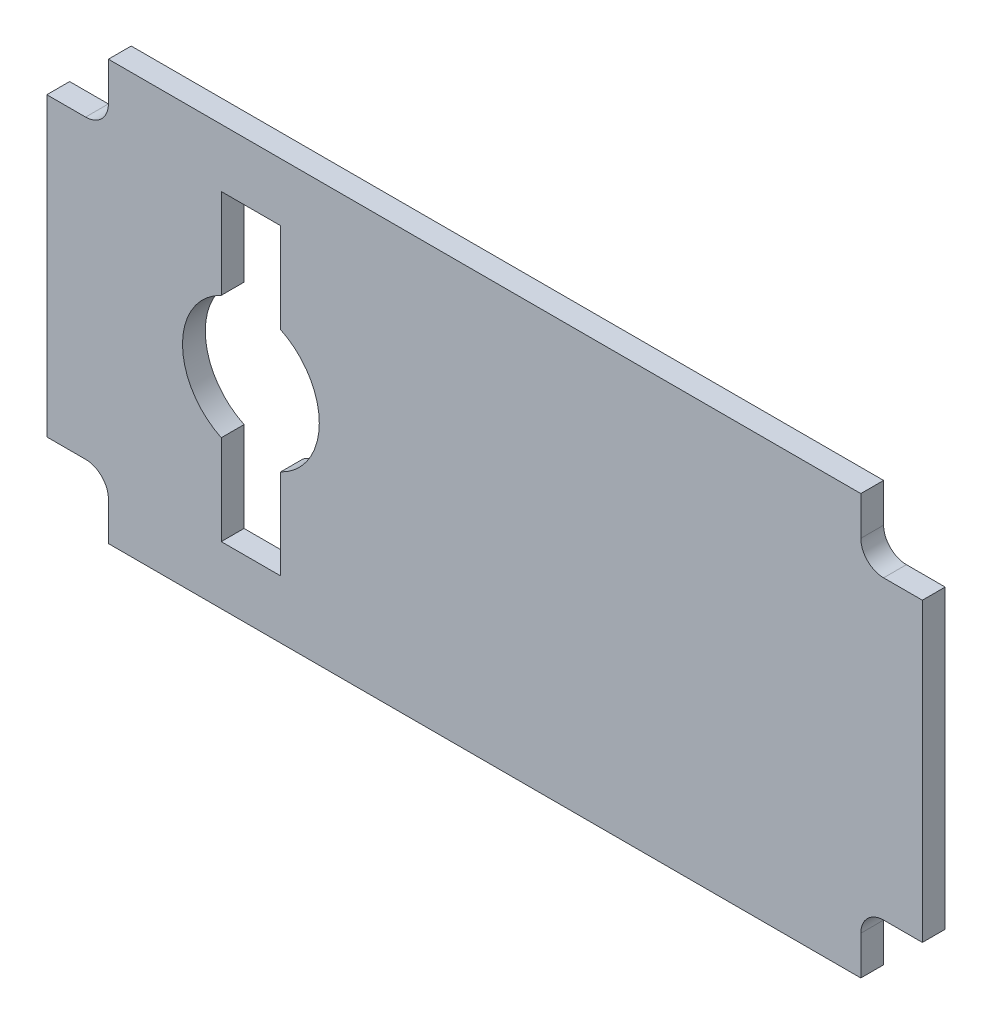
ISO-10303-21;
HEADER;
FILE_DESCRIPTION(('STEP AP214'),'2;1');
FILE_NAME('part.step','',(''),(''),'','','');
FILE_SCHEMA(('AUTOMOTIVE_DESIGN { 1 0 10303 214 1 1 1 1 }'));
ENDSEC;
DATA;
#1=APPLICATION_CONTEXT('core data for automotive mechanical design processes');
#2=APPLICATION_PROTOCOL_DEFINITION('international standard','automotive_design',2000,#1);
#3=PRODUCT_CONTEXT('',#1,'mechanical');
#4=PRODUCT('Part','Part','',(#3));
#5=PRODUCT_RELATED_PRODUCT_CATEGORY('part','',(#4));
#6=PRODUCT_DEFINITION_FORMATION('','',#4);
#7=PRODUCT_DEFINITION_CONTEXT('part definition',#1,'design');
#8=PRODUCT_DEFINITION('design','',#6,#7);
#9=PRODUCT_DEFINITION_SHAPE('','',#8);
#10=(LENGTH_UNIT() NAMED_UNIT(*) SI_UNIT(.MILLI.,.METRE.));
#11=(NAMED_UNIT(*) PLANE_ANGLE_UNIT() SI_UNIT($,.RADIAN.));
#12=(NAMED_UNIT(*) SI_UNIT($,.STERADIAN.) SOLID_ANGLE_UNIT());
#13=UNCERTAINTY_MEASURE_WITH_UNIT(LENGTH_MEASURE(1.E-05),#10,'distance_accuracy_value','');
#14=(GEOMETRIC_REPRESENTATION_CONTEXT(3) GLOBAL_UNCERTAINTY_ASSIGNED_CONTEXT((#13)) GLOBAL_UNIT_ASSIGNED_CONTEXT((#10,
#11,#12)) REPRESENTATION_CONTEXT('',''));
#15=CARTESIAN_POINT('',(0.,0.,0.));
#16=DIRECTION('',(0.,0.,1.));
#17=DIRECTION('',(1.,0.,0.));
#18=AXIS2_PLACEMENT_3D('',#15,#16,#17);
#19=CARTESIAN_POINT('',(-17.5,-7.50000000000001,1.));
#20=DIRECTION('',(0.,0.,-1.));
#21=DIRECTION('',(-1.,0.,0.));
#22=AXIS2_PLACEMENT_3D('',#19,#20,#21);
#23=PLANE('',#22);
#24=DIRECTION('',(0.,-1.,0.));
#25=VECTOR('',#24,1.);
#26=CARTESIAN_POINT('',(-16.5,-9.19999999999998,1.));
#27=LINE('',#26,#25);
#28=CARTESIAN_POINT('',(-16.5,-7.50000000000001,1.));
#29=VERTEX_POINT('',#28);
#30=CARTESIAN_POINT('',(-16.5,-9.19999999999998,1.));
#31=VERTEX_POINT('',#30);
#32=EDGE_CURVE('E286',#29,#31,#27,.T.);
#33=ORIENTED_EDGE('',*,*,#32,.T.);
#34=DIRECTION('',(1.,0.,0.));
#35=VECTOR('',#34,1.);
#36=CARTESIAN_POINT('',(-16.5,-9.19999999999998,1.));
#37=LINE('',#36,#35);
#38=CARTESIAN_POINT('',(16.5,-9.19999999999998,1.));
#39=VERTEX_POINT('',#38);
#40=EDGE_CURVE('E289',#31,#39,#37,.T.);
#41=ORIENTED_EDGE('',*,*,#40,.T.);
#42=DIRECTION('',(0.,1.,0.));
#43=VECTOR('',#42,1.);
#44=CARTESIAN_POINT('',(16.5,-7.5,1.));
#45=LINE('',#44,#43);
#46=CARTESIAN_POINT('',(16.5,-7.5,1.));
#47=VERTEX_POINT('',#46);
#48=EDGE_CURVE('E291',#39,#47,#45,.T.);
#49=ORIENTED_EDGE('',*,*,#48,.T.);
#50=CARTESIAN_POINT('',(17.5,-7.5,1.));
#51=DIRECTION('',(0.,0.,-1.));
#52=DIRECTION('',(-1.,0.,0.));
#53=AXIS2_PLACEMENT_3D('',#50,#51,#52);
#54=CIRCLE('',#53,0.999999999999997);
#55=CARTESIAN_POINT('',(17.5,-6.5,1.));
#56=VERTEX_POINT('',#55);
#57=EDGE_CURVE('E293',#47,#56,#54,.T.);
#58=ORIENTED_EDGE('',*,*,#57,.T.);
#59=DIRECTION('',(1.,0.,0.));
#60=VECTOR('',#59,1.);
#61=CARTESIAN_POINT('',(19.2,-6.5,1.));
#62=LINE('',#61,#60);
#63=CARTESIAN_POINT('',(19.2,-6.5,1.));
#64=VERTEX_POINT('',#63);
#65=EDGE_CURVE('E295',#56,#64,#62,.T.);
#66=ORIENTED_EDGE('',*,*,#65,.T.);
#67=DIRECTION('',(0.,1.,0.));
#68=VECTOR('',#67,1.);
#69=CARTESIAN_POINT('',(19.2,-6.5,1.));
#70=LINE('',#69,#68);
#71=CARTESIAN_POINT('',(19.2,6.5,1.));
#72=VERTEX_POINT('',#71);
#73=EDGE_CURVE('E297',#64,#72,#70,.T.);
#74=ORIENTED_EDGE('',*,*,#73,.T.);
#75=DIRECTION('',(-1.,0.,0.));
#76=VECTOR('',#75,1.);
#77=CARTESIAN_POINT('',(17.5,6.50000000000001,1.));
#78=LINE('',#77,#76);
#79=CARTESIAN_POINT('',(17.5,6.50000000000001,1.));
#80=VERTEX_POINT('',#79);
#81=EDGE_CURVE('E299',#72,#80,#78,.T.);
#82=ORIENTED_EDGE('',*,*,#81,.T.);
#83=CARTESIAN_POINT('',(17.5,7.49999999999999,1.));
#84=DIRECTION('',(0.,0.,-1.));
#85=DIRECTION('',(-1.,0.,0.));
#86=AXIS2_PLACEMENT_3D('',#83,#84,#85);
#87=CIRCLE('',#86,0.999999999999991);
#88=CARTESIAN_POINT('',(16.5,7.5,1.));
#89=VERTEX_POINT('',#88);
#90=EDGE_CURVE('E301',#80,#89,#87,.T.);
#91=ORIENTED_EDGE('',*,*,#90,.T.);
#92=DIRECTION('',(0.,1.,0.));
#93=VECTOR('',#92,1.);
#94=CARTESIAN_POINT('',(16.5,9.2,1.));
#95=LINE('',#94,#93);
#96=CARTESIAN_POINT('',(16.5,9.2,1.));
#97=VERTEX_POINT('',#96);
#98=EDGE_CURVE('E303',#89,#97,#95,.T.);
#99=ORIENTED_EDGE('',*,*,#98,.T.);
#100=DIRECTION('',(-1.,0.,0.));
#101=VECTOR('',#100,1.);
#102=CARTESIAN_POINT('',(16.5,9.2,1.));
#103=LINE('',#102,#101);
#104=CARTESIAN_POINT('',(-16.5,9.2,1.));
#105=VERTEX_POINT('',#104);
#106=EDGE_CURVE('E305',#97,#105,#103,.T.);
#107=ORIENTED_EDGE('',*,*,#106,.T.);
#108=DIRECTION('',(0.,-1.,0.));
#109=VECTOR('',#108,1.);
#110=CARTESIAN_POINT('',(-16.5,7.5,1.));
#111=LINE('',#110,#109);
#112=CARTESIAN_POINT('',(-16.5,7.5,1.));
#113=VERTEX_POINT('',#112);
#114=EDGE_CURVE('E307',#105,#113,#111,.T.);
#115=ORIENTED_EDGE('',*,*,#114,.T.);
#116=CARTESIAN_POINT('',(-17.5,7.5,1.));
#117=DIRECTION('',(0.,0.,-1.));
#118=DIRECTION('',(-1.,0.,0.));
#119=AXIS2_PLACEMENT_3D('',#116,#117,#118);
#120=CIRCLE('',#119,0.999999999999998);
#121=CARTESIAN_POINT('',(-17.5,6.5,1.));
#122=VERTEX_POINT('',#121);
#123=EDGE_CURVE('E309',#113,#122,#120,.T.);
#124=ORIENTED_EDGE('',*,*,#123,.T.);
#125=DIRECTION('',(-1.,0.,0.));
#126=VECTOR('',#125,1.);
#127=CARTESIAN_POINT('',(-19.2,6.49999999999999,1.));
#128=LINE('',#127,#126);
#129=CARTESIAN_POINT('',(-19.2,6.49999999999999,1.));
#130=VERTEX_POINT('',#129);
#131=EDGE_CURVE('E311',#122,#130,#128,.T.);
#132=ORIENTED_EDGE('',*,*,#131,.T.);
#133=DIRECTION('',(0.,-1.,0.));
#134=VECTOR('',#133,1.);
#135=CARTESIAN_POINT('',(-19.2,6.49999999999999,1.));
#136=LINE('',#135,#134);
#137=CARTESIAN_POINT('',(-19.2,-6.50000000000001,1.));
#138=VERTEX_POINT('',#137);
#139=EDGE_CURVE('E313',#130,#138,#136,.T.);
#140=ORIENTED_EDGE('',*,*,#139,.T.);
#141=DIRECTION('',(1.,0.,0.));
#142=VECTOR('',#141,1.);
#143=CARTESIAN_POINT('',(-17.5,-6.50000000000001,1.));
#144=LINE('',#143,#142);
#145=CARTESIAN_POINT('',(-17.5,-6.50000000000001,1.));
#146=VERTEX_POINT('',#145);
#147=EDGE_CURVE('E315',#138,#146,#144,.T.);
#148=ORIENTED_EDGE('',*,*,#147,.T.);
#149=CARTESIAN_POINT('',(-17.5,-7.50000000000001,1.));
#150=DIRECTION('',(0.,0.,-1.));
#151=DIRECTION('',(-1.,0.,0.));
#152=AXIS2_PLACEMENT_3D('',#149,#150,#151);
#153=CIRCLE('',#152,0.999999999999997);
#154=EDGE_CURVE('E317',#146,#29,#153,.T.);
#155=ORIENTED_EDGE('',*,*,#154,.T.);
#156=EDGE_LOOP('',(#33,#41,#49,#58,#66,#74,#82,#91,#99,#107,#115,#124,#132,#140,#148,#155));
#157=FACE_BOUND('',#156,.T.);
#158=CARTESIAN_POINT('',(-10.25,0.,1.));
#159=DIRECTION('',(0.,0.,1.));
#160=DIRECTION('',(1.,0.,0.));
#161=AXIS2_PLACEMENT_3D('',#158,#159,#160);
#162=CIRCLE('',#161,3.);
#163=CARTESIAN_POINT('',(-11.55,2.70370116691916,1.));
#164=VERTEX_POINT('',#163);
#165=CARTESIAN_POINT('',(-11.55,-2.70370116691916,1.));
#166=VERTEX_POINT('',#165);
#167=EDGE_CURVE('E205',#164,#166,#162,.T.);
#168=ORIENTED_EDGE('',*,*,#167,.F.);
#169=DIRECTION('',(0.,-1.,0.));
#170=VECTOR('',#169,1.);
#171=CARTESIAN_POINT('',(-11.55,2.70370116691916,1.));
#172=LINE('',#171,#170);
#173=CARTESIAN_POINT('',(-11.55,6.65,1.));
#174=VERTEX_POINT('',#173);
#175=EDGE_CURVE('E240',#174,#164,#172,.T.);
#176=ORIENTED_EDGE('',*,*,#175,.F.);
#177=DIRECTION('',(-1.,0.,0.));
#178=VECTOR('',#177,1.);
#179=CARTESIAN_POINT('',(-11.55,6.65,1.));
#180=LINE('',#179,#178);
#181=CARTESIAN_POINT('',(-8.94999999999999,6.65,1.));
#182=VERTEX_POINT('',#181);
#183=EDGE_CURVE('E238',#182,#174,#180,.T.);
#184=ORIENTED_EDGE('',*,*,#183,.F.);
#185=DIRECTION('',(0.,1.,0.));
#186=VECTOR('',#185,1.);
#187=CARTESIAN_POINT('',(-8.95,2.70370116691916,1.));
#188=LINE('',#187,#186);
#189=CARTESIAN_POINT('',(-8.95,2.70370116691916,1.));
#190=VERTEX_POINT('',#189);
#191=EDGE_CURVE('E236',#190,#182,#188,.T.);
#192=ORIENTED_EDGE('',*,*,#191,.F.);
#193=CARTESIAN_POINT('',(-10.25,0.,1.));
#194=DIRECTION('',(0.,0.,1.));
#195=DIRECTION('',(1.,0.,0.));
#196=AXIS2_PLACEMENT_3D('',#193,#194,#195);
#197=CIRCLE('',#196,3.);
#198=CARTESIAN_POINT('',(-8.95,-2.70370116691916,1.));
#199=VERTEX_POINT('',#198);
#200=EDGE_CURVE('E234',#199,#190,#197,.T.);
#201=ORIENTED_EDGE('',*,*,#200,.F.);
#202=DIRECTION('',(0.,1.,0.));
#203=VECTOR('',#202,1.);
#204=CARTESIAN_POINT('',(-8.94999999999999,-6.65,1.));
#205=LINE('',#204,#203);
#206=CARTESIAN_POINT('',(-8.94999999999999,-6.65,1.));
#207=VERTEX_POINT('',#206);
#208=EDGE_CURVE('E232',#207,#199,#205,.T.);
#209=ORIENTED_EDGE('',*,*,#208,.F.);
#210=DIRECTION('',(1.,0.,0.));
#211=VECTOR('',#210,1.);
#212=CARTESIAN_POINT('',(-11.55,-6.65,1.));
#213=LINE('',#212,#211);
#214=CARTESIAN_POINT('',(-11.55,-6.65,1.));
#215=VERTEX_POINT('',#214);
#216=EDGE_CURVE('E230',#215,#207,#213,.T.);
#217=ORIENTED_EDGE('',*,*,#216,.F.);
#218=DIRECTION('',(0.,-1.,0.));
#219=VECTOR('',#218,1.);
#220=CARTESIAN_POINT('',(-11.55,-6.65,1.));
#221=LINE('',#220,#219);
#222=EDGE_CURVE('E228',#166,#215,#221,.T.);
#223=ORIENTED_EDGE('',*,*,#222,.F.);
#224=EDGE_LOOP('',(#168,#176,#184,#192,#201,#209,#217,#223));
#225=FACE_BOUND('',#224,.T.);
#226=ADVANCED_FACE('F29',(#157,#225),#23,.F.);
#227=CARTESIAN_POINT('',(-17.5,-7.50000000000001,0.));
#228=DIRECTION('',(0.,0.,-1.));
#229=DIRECTION('',(-1.,0.,0.));
#230=AXIS2_PLACEMENT_3D('',#227,#228,#229);
#231=PLANE('',#230);
#232=DIRECTION('',(0.,-1.,0.));
#233=VECTOR('',#232,1.);
#234=CARTESIAN_POINT('',(-16.5,-9.19999999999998,0.));
#235=LINE('',#234,#233);
#236=CARTESIAN_POINT('',(-16.5,-7.50000000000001,0.));
#237=VERTEX_POINT('',#236);
#238=CARTESIAN_POINT('',(-16.5,-9.19999999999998,0.));
#239=VERTEX_POINT('',#238);
#240=EDGE_CURVE('E206',#237,#239,#235,.T.);
#241=ORIENTED_EDGE('',*,*,#240,.F.);
#242=CARTESIAN_POINT('',(-17.5,-7.50000000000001,0.));
#243=DIRECTION('',(0.,0.,-1.));
#244=DIRECTION('',(-1.,0.,0.));
#245=AXIS2_PLACEMENT_3D('',#242,#243,#244);
#246=CIRCLE('',#245,0.999999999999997);
#247=CARTESIAN_POINT('',(-17.5,-6.50000000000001,0.));
#248=VERTEX_POINT('',#247);
#249=EDGE_CURVE('E284',#248,#237,#246,.T.);
#250=ORIENTED_EDGE('',*,*,#249,.F.);
#251=DIRECTION('',(1.,0.,0.));
#252=VECTOR('',#251,1.);
#253=CARTESIAN_POINT('',(-17.5,-6.50000000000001,0.));
#254=LINE('',#253,#252);
#255=CARTESIAN_POINT('',(-19.2,-6.50000000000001,0.));
#256=VERTEX_POINT('',#255);
#257=EDGE_CURVE('E282',#256,#248,#254,.T.);
#258=ORIENTED_EDGE('',*,*,#257,.F.);
#259=DIRECTION('',(0.,-1.,0.));
#260=VECTOR('',#259,1.);
#261=CARTESIAN_POINT('',(-19.2,6.49999999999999,0.));
#262=LINE('',#261,#260);
#263=CARTESIAN_POINT('',(-19.2,6.49999999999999,0.));
#264=VERTEX_POINT('',#263);
#265=EDGE_CURVE('E280',#264,#256,#262,.T.);
#266=ORIENTED_EDGE('',*,*,#265,.F.);
#267=DIRECTION('',(-1.,0.,0.));
#268=VECTOR('',#267,1.);
#269=CARTESIAN_POINT('',(-19.2,6.49999999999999,0.));
#270=LINE('',#269,#268);
#271=CARTESIAN_POINT('',(-17.5,6.5,0.));
#272=VERTEX_POINT('',#271);
#273=EDGE_CURVE('E278',#272,#264,#270,.T.);
#274=ORIENTED_EDGE('',*,*,#273,.F.);
#275=CARTESIAN_POINT('',(-17.5,7.5,0.));
#276=DIRECTION('',(0.,0.,-1.));
#277=DIRECTION('',(-1.,0.,0.));
#278=AXIS2_PLACEMENT_3D('',#275,#276,#277);
#279=CIRCLE('',#278,0.999999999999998);
#280=CARTESIAN_POINT('',(-16.5,7.5,0.));
#281=VERTEX_POINT('',#280);
#282=EDGE_CURVE('E276',#281,#272,#279,.T.);
#283=ORIENTED_EDGE('',*,*,#282,.F.);
#284=DIRECTION('',(0.,-1.,0.));
#285=VECTOR('',#284,1.);
#286=CARTESIAN_POINT('',(-16.5,7.5,0.));
#287=LINE('',#286,#285);
#288=CARTESIAN_POINT('',(-16.5,9.2,0.));
#289=VERTEX_POINT('',#288);
#290=EDGE_CURVE('E274',#289,#281,#287,.T.);
#291=ORIENTED_EDGE('',*,*,#290,.F.);
#292=DIRECTION('',(-1.,0.,0.));
#293=VECTOR('',#292,1.);
#294=CARTESIAN_POINT('',(16.5,9.2,0.));
#295=LINE('',#294,#293);
#296=CARTESIAN_POINT('',(16.5,9.2,0.));
#297=VERTEX_POINT('',#296);
#298=EDGE_CURVE('E272',#297,#289,#295,.T.);
#299=ORIENTED_EDGE('',*,*,#298,.F.);
#300=DIRECTION('',(0.,1.,0.));
#301=VECTOR('',#300,1.);
#302=CARTESIAN_POINT('',(16.5,9.2,0.));
#303=LINE('',#302,#301);
#304=CARTESIAN_POINT('',(16.5,7.5,0.));
#305=VERTEX_POINT('',#304);
#306=EDGE_CURVE('E270',#305,#297,#303,.T.);
#307=ORIENTED_EDGE('',*,*,#306,.F.);
#308=CARTESIAN_POINT('',(17.5,7.49999999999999,0.));
#309=DIRECTION('',(0.,0.,-1.));
#310=DIRECTION('',(-1.,0.,0.));
#311=AXIS2_PLACEMENT_3D('',#308,#309,#310);
#312=CIRCLE('',#311,0.999999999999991);
#313=CARTESIAN_POINT('',(17.5,6.50000000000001,0.));
#314=VERTEX_POINT('',#313);
#315=EDGE_CURVE('E268',#314,#305,#312,.T.);
#316=ORIENTED_EDGE('',*,*,#315,.F.);
#317=DIRECTION('',(-1.,0.,0.));
#318=VECTOR('',#317,1.);
#319=CARTESIAN_POINT('',(17.5,6.50000000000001,0.));
#320=LINE('',#319,#318);
#321=CARTESIAN_POINT('',(19.2,6.5,0.));
#322=VERTEX_POINT('',#321);
#323=EDGE_CURVE('E266',#322,#314,#320,.T.);
#324=ORIENTED_EDGE('',*,*,#323,.F.);
#325=DIRECTION('',(0.,1.,0.));
#326=VECTOR('',#325,1.);
#327=CARTESIAN_POINT('',(19.2,-6.5,0.));
#328=LINE('',#327,#326);
#329=CARTESIAN_POINT('',(19.2,-6.5,0.));
#330=VERTEX_POINT('',#329);
#331=EDGE_CURVE('E264',#330,#322,#328,.T.);
#332=ORIENTED_EDGE('',*,*,#331,.F.);
#333=DIRECTION('',(1.,0.,0.));
#334=VECTOR('',#333,1.);
#335=CARTESIAN_POINT('',(19.2,-6.5,0.));
#336=LINE('',#335,#334);
#337=CARTESIAN_POINT('',(17.5,-6.5,0.));
#338=VERTEX_POINT('',#337);
#339=EDGE_CURVE('E262',#338,#330,#336,.T.);
#340=ORIENTED_EDGE('',*,*,#339,.F.);
#341=CARTESIAN_POINT('',(17.5,-7.5,0.));
#342=DIRECTION('',(0.,0.,-1.));
#343=DIRECTION('',(-1.,0.,0.));
#344=AXIS2_PLACEMENT_3D('',#341,#342,#343);
#345=CIRCLE('',#344,0.999999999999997);
#346=CARTESIAN_POINT('',(16.5,-7.5,0.));
#347=VERTEX_POINT('',#346);
#348=EDGE_CURVE('E260',#347,#338,#345,.T.);
#349=ORIENTED_EDGE('',*,*,#348,.F.);
#350=DIRECTION('',(0.,1.,0.));
#351=VECTOR('',#350,1.);
#352=CARTESIAN_POINT('',(16.5,-7.5,0.));
#353=LINE('',#352,#351);
#354=CARTESIAN_POINT('',(16.5,-9.19999999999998,0.));
#355=VERTEX_POINT('',#354);
#356=EDGE_CURVE('E258',#355,#347,#353,.T.);
#357=ORIENTED_EDGE('',*,*,#356,.F.);
#358=DIRECTION('',(1.,0.,0.));
#359=VECTOR('',#358,1.);
#360=CARTESIAN_POINT('',(-16.5,-9.19999999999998,0.));
#361=LINE('',#360,#359);
#362=EDGE_CURVE('E256',#239,#355,#361,.T.);
#363=ORIENTED_EDGE('',*,*,#362,.F.);
#364=EDGE_LOOP('',(#241,#250,#258,#266,#274,#283,#291,#299,#307,#316,#324,#332,#340,#349,#357,#363));
#365=FACE_BOUND('',#364,.T.);
#366=DIRECTION('',(0.,-1.,0.));
#367=VECTOR('',#366,1.);
#368=CARTESIAN_POINT('',(-11.55,2.70370116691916,0.));
#369=LINE('',#368,#367);
#370=CARTESIAN_POINT('',(-11.55,6.65,0.));
#371=VERTEX_POINT('',#370);
#372=CARTESIAN_POINT('',(-11.55,2.70370116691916,0.));
#373=VERTEX_POINT('',#372);
#374=EDGE_CURVE('E211',#371,#373,#369,.T.);
#375=ORIENTED_EDGE('',*,*,#374,.T.);
#376=CARTESIAN_POINT('',(-10.25,0.,0.));
#377=DIRECTION('',(0.,0.,1.));
#378=DIRECTION('',(1.,0.,0.));
#379=AXIS2_PLACEMENT_3D('',#376,#377,#378);
#380=CIRCLE('',#379,3.);
#381=CARTESIAN_POINT('',(-11.55,-2.70370116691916,0.));
#382=VERTEX_POINT('',#381);
#383=EDGE_CURVE('E52',#373,#382,#380,.T.);
#384=ORIENTED_EDGE('',*,*,#383,.T.);
#385=DIRECTION('',(0.,-1.,0.));
#386=VECTOR('',#385,1.);
#387=CARTESIAN_POINT('',(-11.55,-6.65,0.));
#388=LINE('',#387,#386);
#389=CARTESIAN_POINT('',(-11.55,-6.65,0.));
#390=VERTEX_POINT('',#389);
#391=EDGE_CURVE('E192',#382,#390,#388,.T.);
#392=ORIENTED_EDGE('',*,*,#391,.T.);
#393=DIRECTION('',(1.,0.,0.));
#394=VECTOR('',#393,1.);
#395=CARTESIAN_POINT('',(-11.55,-6.65,0.));
#396=LINE('',#395,#394);
#397=CARTESIAN_POINT('',(-8.94999999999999,-6.65,0.));
#398=VERTEX_POINT('',#397);
#399=EDGE_CURVE('E201',#390,#398,#396,.T.);
#400=ORIENTED_EDGE('',*,*,#399,.T.);
#401=DIRECTION('',(0.,1.,0.));
#402=VECTOR('',#401,1.);
#403=CARTESIAN_POINT('',(-8.94999999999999,-6.65,0.));
#404=LINE('',#403,#402);
#405=CARTESIAN_POINT('',(-8.95,-2.70370116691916,0.));
#406=VERTEX_POINT('',#405);
#407=EDGE_CURVE('E215',#398,#406,#404,.T.);
#408=ORIENTED_EDGE('',*,*,#407,.T.);
#409=CARTESIAN_POINT('',(-10.25,0.,0.));
#410=DIRECTION('',(0.,0.,1.));
#411=DIRECTION('',(1.,0.,0.));
#412=AXIS2_PLACEMENT_3D('',#409,#410,#411);
#413=CIRCLE('',#412,3.);
#414=CARTESIAN_POINT('',(-8.95,2.70370116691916,0.));
#415=VERTEX_POINT('',#414);
#416=EDGE_CURVE('E218',#406,#415,#413,.T.);
#417=ORIENTED_EDGE('',*,*,#416,.T.);
#418=DIRECTION('',(0.,1.,0.));
#419=VECTOR('',#418,1.);
#420=CARTESIAN_POINT('',(-8.95,2.70370116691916,0.));
#421=LINE('',#420,#419);
#422=CARTESIAN_POINT('',(-8.94999999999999,6.65,0.));
#423=VERTEX_POINT('',#422);
#424=EDGE_CURVE('E221',#415,#423,#421,.T.);
#425=ORIENTED_EDGE('',*,*,#424,.T.);
#426=DIRECTION('',(-1.,0.,0.));
#427=VECTOR('',#426,1.);
#428=CARTESIAN_POINT('',(-11.55,6.65,0.));
#429=LINE('',#428,#427);
#430=EDGE_CURVE('E224',#423,#371,#429,.T.);
#431=ORIENTED_EDGE('',*,*,#430,.T.);
#432=EDGE_LOOP('',(#375,#384,#392,#400,#408,#417,#425,#431));
#433=FACE_BOUND('',#432,.T.);
#434=ADVANCED_FACE('F209',(#365,#433),#231,.T.);
#435=CARTESIAN_POINT('',(-16.5,-9.19999999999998,1.));
#436=DIRECTION('',(1.,0.,0.));
#437=DIRECTION('',(0.,0.,-1.));
#438=AXIS2_PLACEMENT_3D('',#435,#436,#437);
#439=PLANE('',#438);
#440=ORIENTED_EDGE('',*,*,#240,.T.);
#441=DIRECTION('',(0.,0.,-1.));
#442=VECTOR('',#441,1.);
#443=CARTESIAN_POINT('',(-16.5,-9.19999999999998,1.));
#444=LINE('',#443,#442);
#445=EDGE_CURVE('E11',#31,#239,#444,.T.);
#446=ORIENTED_EDGE('',*,*,#445,.F.);
#447=ORIENTED_EDGE('',*,*,#32,.F.);
#448=DIRECTION('',(0.,0.,-1.));
#449=VECTOR('',#448,1.);
#450=CARTESIAN_POINT('',(-16.5,-7.50000000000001,1.));
#451=LINE('',#450,#449);
#452=EDGE_CURVE('E319',#29,#237,#451,.T.);
#453=ORIENTED_EDGE('',*,*,#452,.T.);
#454=EDGE_LOOP('',(#440,#446,#447,#453));
#455=FACE_BOUND('',#454,.T.);
#456=ADVANCED_FACE('F31',(#455),#439,.F.);
#457=CARTESIAN_POINT('',(-16.5,-9.19999999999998,1.));
#458=DIRECTION('',(0.,1.,0.));
#459=DIRECTION('',(0.,0.,1.));
#460=AXIS2_PLACEMENT_3D('',#457,#458,#459);
#461=PLANE('',#460);
#462=ORIENTED_EDGE('',*,*,#362,.T.);
#463=DIRECTION('',(0.,0.,-1.));
#464=VECTOR('',#463,1.);
#465=CARTESIAN_POINT('',(16.5,-9.19999999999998,1.));
#466=LINE('',#465,#464);
#467=EDGE_CURVE('E37',#39,#355,#466,.T.);
#468=ORIENTED_EDGE('',*,*,#467,.F.);
#469=ORIENTED_EDGE('',*,*,#40,.F.);
#470=ORIENTED_EDGE('',*,*,#445,.T.);
#471=EDGE_LOOP('',(#462,#468,#469,#470));
#472=FACE_BOUND('',#471,.T.);
#473=ADVANCED_FACE('F387',(#472),#461,.F.);
#474=CARTESIAN_POINT('',(16.5,-7.5,1.));
#475=DIRECTION('',(-1.,0.,0.));
#476=DIRECTION('',(0.,0.,1.));
#477=AXIS2_PLACEMENT_3D('',#474,#475,#476);
#478=PLANE('',#477);
#479=ORIENTED_EDGE('',*,*,#356,.T.);
#480=DIRECTION('',(0.,0.,-1.));
#481=VECTOR('',#480,1.);
#482=CARTESIAN_POINT('',(16.5,-7.5,1.));
#483=LINE('',#482,#481);
#484=EDGE_CURVE('E358',#47,#347,#483,.T.);
#485=ORIENTED_EDGE('',*,*,#484,.F.);
#486=ORIENTED_EDGE('',*,*,#48,.F.);
#487=ORIENTED_EDGE('',*,*,#467,.T.);
#488=EDGE_LOOP('',(#479,#485,#486,#487));
#489=FACE_BOUND('',#488,.T.);
#490=ADVANCED_FACE('F365',(#489),#478,.F.);
#491=CARTESIAN_POINT('',(17.5,-7.5,1.));
#492=DIRECTION('',(0.,0.,-1.));
#493=DIRECTION('',(-1.,0.,0.));
#494=AXIS2_PLACEMENT_3D('',#491,#492,#493);
#495=CYLINDRICAL_SURFACE('',#494,0.999999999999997);
#496=ORIENTED_EDGE('',*,*,#348,.T.);
#497=DIRECTION('',(0.,0.,-1.));
#498=VECTOR('',#497,1.);
#499=CARTESIAN_POINT('',(17.5,-6.5,1.));
#500=LINE('',#499,#498);
#501=EDGE_CURVE('E355',#56,#338,#500,.T.);
#502=ORIENTED_EDGE('',*,*,#501,.F.);
#503=ORIENTED_EDGE('',*,*,#57,.F.);
#504=ORIENTED_EDGE('',*,*,#484,.T.);
#505=EDGE_LOOP('',(#496,#502,#503,#504));
#506=FACE_BOUND('',#505,.T.);
#507=ADVANCED_FACE('F375',(#506),#495,.F.);
#508=CARTESIAN_POINT('',(19.2,-6.5,1.));
#509=DIRECTION('',(0.,1.,0.));
#510=DIRECTION('',(0.,0.,1.));
#511=AXIS2_PLACEMENT_3D('',#508,#509,#510);
#512=PLANE('',#511);
#513=ORIENTED_EDGE('',*,*,#339,.T.);
#514=DIRECTION('',(0.,0.,-1.));
#515=VECTOR('',#514,1.);
#516=CARTESIAN_POINT('',(19.2,-6.5,1.));
#517=LINE('',#516,#515);
#518=EDGE_CURVE('E352',#64,#330,#517,.T.);
#519=ORIENTED_EDGE('',*,*,#518,.F.);
#520=ORIENTED_EDGE('',*,*,#65,.F.);
#521=ORIENTED_EDGE('',*,*,#501,.T.);
#522=EDGE_LOOP('',(#513,#519,#520,#521));
#523=FACE_BOUND('',#522,.T.);
#524=ADVANCED_FACE('F379',(#523),#512,.F.);
#525=CARTESIAN_POINT('',(19.2,-6.5,1.));
#526=DIRECTION('',(-1.,0.,0.));
#527=DIRECTION('',(0.,0.,1.));
#528=AXIS2_PLACEMENT_3D('',#525,#526,#527);
#529=PLANE('',#528);
#530=ORIENTED_EDGE('',*,*,#331,.T.);
#531=DIRECTION('',(0.,0.,-1.));
#532=VECTOR('',#531,1.);
#533=CARTESIAN_POINT('',(19.2,6.5,1.));
#534=LINE('',#533,#532);
#535=EDGE_CURVE('E349',#72,#322,#534,.T.);
#536=ORIENTED_EDGE('',*,*,#535,.F.);
#537=ORIENTED_EDGE('',*,*,#73,.F.);
#538=ORIENTED_EDGE('',*,*,#518,.T.);
#539=EDGE_LOOP('',(#530,#536,#537,#538));
#540=FACE_BOUND('',#539,.T.);
#541=ADVANCED_FACE('F440',(#540),#529,.F.);
#542=CARTESIAN_POINT('',(17.5,6.50000000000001,1.));
#543=DIRECTION('',(0.,-1.,0.));
#544=DIRECTION('',(1.,0.,0.));
#545=AXIS2_PLACEMENT_3D('',#542,#543,#544);
#546=PLANE('',#545);
#547=ORIENTED_EDGE('',*,*,#323,.T.);
#548=DIRECTION('',(0.,0.,-1.));
#549=VECTOR('',#548,1.);
#550=CARTESIAN_POINT('',(17.5,6.50000000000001,1.));
#551=LINE('',#550,#549);
#552=EDGE_CURVE('E346',#80,#314,#551,.T.);
#553=ORIENTED_EDGE('',*,*,#552,.F.);
#554=ORIENTED_EDGE('',*,*,#81,.F.);
#555=ORIENTED_EDGE('',*,*,#535,.T.);
#556=EDGE_LOOP('',(#547,#553,#554,#555));
#557=FACE_BOUND('',#556,.T.);
#558=ADVANCED_FACE('F437',(#557),#546,.F.);
#559=CARTESIAN_POINT('',(17.5,7.49999999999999,1.));
#560=DIRECTION('',(0.,0.,-1.));
#561=DIRECTION('',(-1.,0.,0.));
#562=AXIS2_PLACEMENT_3D('',#559,#560,#561);
#563=CYLINDRICAL_SURFACE('',#562,0.999999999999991);
#564=ORIENTED_EDGE('',*,*,#315,.T.);
#565=DIRECTION('',(0.,0.,-1.));
#566=VECTOR('',#565,1.);
#567=CARTESIAN_POINT('',(16.5,7.5,1.));
#568=LINE('',#567,#566);
#569=EDGE_CURVE('E343',#89,#305,#568,.T.);
#570=ORIENTED_EDGE('',*,*,#569,.F.);
#571=ORIENTED_EDGE('',*,*,#90,.F.);
#572=ORIENTED_EDGE('',*,*,#552,.T.);
#573=EDGE_LOOP('',(#564,#570,#571,#572));
#574=FACE_BOUND('',#573,.T.);
#575=ADVANCED_FACE('F433',(#574),#563,.F.);
#576=CARTESIAN_POINT('',(16.5,9.2,1.));
#577=DIRECTION('',(-1.,0.,0.));
#578=DIRECTION('',(0.,-1.,0.));
#579=AXIS2_PLACEMENT_3D('',#576,#577,#578);
#580=PLANE('',#579);
#581=ORIENTED_EDGE('',*,*,#306,.T.);
#582=DIRECTION('',(0.,0.,-1.));
#583=VECTOR('',#582,1.);
#584=CARTESIAN_POINT('',(16.5,9.2,1.));
#585=LINE('',#584,#583);
#586=EDGE_CURVE('E340',#97,#297,#585,.T.);
#587=ORIENTED_EDGE('',*,*,#586,.F.);
#588=ORIENTED_EDGE('',*,*,#98,.F.);
#589=ORIENTED_EDGE('',*,*,#569,.T.);
#590=EDGE_LOOP('',(#581,#587,#588,#589));
#591=FACE_BOUND('',#590,.T.);
#592=ADVANCED_FACE('F429',(#591),#580,.F.);
#593=CARTESIAN_POINT('',(16.5,9.2,1.));
#594=DIRECTION('',(0.,-1.,0.));
#595=DIRECTION('',(0.,0.,-1.));
#596=AXIS2_PLACEMENT_3D('',#593,#594,#595);
#597=PLANE('',#596);
#598=ORIENTED_EDGE('',*,*,#298,.T.);
#599=DIRECTION('',(0.,0.,-1.));
#600=VECTOR('',#599,1.);
#601=CARTESIAN_POINT('',(-16.5,9.2,1.));
#602=LINE('',#601,#600);
#603=EDGE_CURVE('E337',#105,#289,#602,.T.);
#604=ORIENTED_EDGE('',*,*,#603,.F.);
#605=ORIENTED_EDGE('',*,*,#106,.F.);
#606=ORIENTED_EDGE('',*,*,#586,.T.);
#607=EDGE_LOOP('',(#598,#604,#605,#606));
#608=FACE_BOUND('',#607,.T.);
#609=ADVANCED_FACE('F424',(#608),#597,.F.);
#610=CARTESIAN_POINT('',(-16.5,7.5,1.));
#611=DIRECTION('',(1.,0.,0.));
#612=DIRECTION('',(0.,0.,-1.));
#613=AXIS2_PLACEMENT_3D('',#610,#611,#612);
#614=PLANE('',#613);
#615=ORIENTED_EDGE('',*,*,#290,.T.);
#616=DIRECTION('',(0.,0.,-1.));
#617=VECTOR('',#616,1.);
#618=CARTESIAN_POINT('',(-16.5,7.5,1.));
#619=LINE('',#618,#617);
#620=EDGE_CURVE('E334',#113,#281,#619,.T.);
#621=ORIENTED_EDGE('',*,*,#620,.F.);
#622=ORIENTED_EDGE('',*,*,#114,.F.);
#623=ORIENTED_EDGE('',*,*,#603,.T.);
#624=EDGE_LOOP('',(#615,#621,#622,#623));
#625=FACE_BOUND('',#624,.T.);
#626=ADVANCED_FACE('F418',(#625),#614,.F.);
#627=CARTESIAN_POINT('',(-17.5,7.5,1.));
#628=DIRECTION('',(0.,0.,-1.));
#629=DIRECTION('',(-1.,0.,0.));
#630=AXIS2_PLACEMENT_3D('',#627,#628,#629);
#631=CYLINDRICAL_SURFACE('',#630,0.999999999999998);
#632=ORIENTED_EDGE('',*,*,#282,.T.);
#633=DIRECTION('',(0.,0.,-1.));
#634=VECTOR('',#633,1.);
#635=CARTESIAN_POINT('',(-17.5,6.5,1.));
#636=LINE('',#635,#634);
#637=EDGE_CURVE('E331',#122,#272,#636,.T.);
#638=ORIENTED_EDGE('',*,*,#637,.F.);
#639=ORIENTED_EDGE('',*,*,#123,.F.);
#640=ORIENTED_EDGE('',*,*,#620,.T.);
#641=EDGE_LOOP('',(#632,#638,#639,#640));
#642=FACE_BOUND('',#641,.T.);
#643=ADVANCED_FACE('F414',(#642),#631,.F.);
#644=CARTESIAN_POINT('',(-19.2,6.49999999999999,1.));
#645=DIRECTION('',(0.,-1.,0.));
#646=DIRECTION('',(1.,0.,0.));
#647=AXIS2_PLACEMENT_3D('',#644,#645,#646);
#648=PLANE('',#647);
#649=ORIENTED_EDGE('',*,*,#273,.T.);
#650=DIRECTION('',(0.,0.,-1.));
#651=VECTOR('',#650,1.);
#652=CARTESIAN_POINT('',(-19.2,6.49999999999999,1.));
#653=LINE('',#652,#651);
#654=EDGE_CURVE('E328',#130,#264,#653,.T.);
#655=ORIENTED_EDGE('',*,*,#654,.F.);
#656=ORIENTED_EDGE('',*,*,#131,.F.);
#657=ORIENTED_EDGE('',*,*,#637,.T.);
#658=EDGE_LOOP('',(#649,#655,#656,#657));
#659=FACE_BOUND('',#658,.T.);
#660=ADVANCED_FACE('F409',(#659),#648,.F.);
#661=CARTESIAN_POINT('',(-19.2,6.49999999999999,1.));
#662=DIRECTION('',(1.,0.,0.));
#663=DIRECTION('',(0.,0.,-1.));
#664=AXIS2_PLACEMENT_3D('',#661,#662,#663);
#665=PLANE('',#664);
#666=ORIENTED_EDGE('',*,*,#265,.T.);
#667=DIRECTION('',(0.,0.,-1.));
#668=VECTOR('',#667,1.);
#669=CARTESIAN_POINT('',(-19.2,-6.50000000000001,1.));
#670=LINE('',#669,#668);
#671=EDGE_CURVE('E325',#138,#256,#670,.T.);
#672=ORIENTED_EDGE('',*,*,#671,.F.);
#673=ORIENTED_EDGE('',*,*,#139,.F.);
#674=ORIENTED_EDGE('',*,*,#654,.T.);
#675=EDGE_LOOP('',(#666,#672,#673,#674));
#676=FACE_BOUND('',#675,.T.);
#677=ADVANCED_FACE('F403',(#676),#665,.F.);
#678=CARTESIAN_POINT('',(-17.5,-6.50000000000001,1.));
#679=DIRECTION('',(0.,1.,0.));
#680=DIRECTION('',(0.,0.,1.));
#681=AXIS2_PLACEMENT_3D('',#678,#679,#680);
#682=PLANE('',#681);
#683=ORIENTED_EDGE('',*,*,#257,.T.);
#684=DIRECTION('',(0.,0.,-1.));
#685=VECTOR('',#684,1.);
#686=CARTESIAN_POINT('',(-17.5,-6.50000000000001,1.));
#687=LINE('',#686,#685);
#688=EDGE_CURVE('E322',#146,#248,#687,.T.);
#689=ORIENTED_EDGE('',*,*,#688,.F.);
#690=ORIENTED_EDGE('',*,*,#147,.F.);
#691=ORIENTED_EDGE('',*,*,#671,.T.);
#692=EDGE_LOOP('',(#683,#689,#690,#691));
#693=FACE_BOUND('',#692,.T.);
#694=ADVANCED_FACE('F399',(#693),#682,.F.);
#695=CARTESIAN_POINT('',(-17.5,-7.50000000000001,1.));
#696=DIRECTION('',(0.,0.,-1.));
#697=DIRECTION('',(-1.,0.,0.));
#698=AXIS2_PLACEMENT_3D('',#695,#696,#697);
#699=CYLINDRICAL_SURFACE('',#698,0.999999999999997);
#700=ORIENTED_EDGE('',*,*,#249,.T.);
#701=ORIENTED_EDGE('',*,*,#452,.F.);
#702=ORIENTED_EDGE('',*,*,#154,.F.);
#703=ORIENTED_EDGE('',*,*,#688,.T.);
#704=EDGE_LOOP('',(#700,#701,#702,#703));
#705=FACE_BOUND('',#704,.T.);
#706=ADVANCED_FACE('F394',(#705),#699,.F.);
#707=CARTESIAN_POINT('',(-10.25,0.,1.));
#708=DIRECTION('',(0.,0.,-1.));
#709=DIRECTION('',(-1.,0.,0.));
#710=AXIS2_PLACEMENT_3D('',#707,#708,#709);
#711=CYLINDRICAL_SURFACE('',#710,3.);
#712=ORIENTED_EDGE('',*,*,#383,.F.);
#713=DIRECTION('',(0.,0.,-1.));
#714=VECTOR('',#713,1.);
#715=CARTESIAN_POINT('',(-11.55,2.70370116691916,1.));
#716=LINE('',#715,#714);
#717=EDGE_CURVE('E242',#164,#373,#716,.T.);
#718=ORIENTED_EDGE('',*,*,#717,.F.);
#719=ORIENTED_EDGE('',*,*,#167,.T.);
#720=DIRECTION('',(0.,0.,-1.));
#721=VECTOR('',#720,1.);
#722=CARTESIAN_POINT('',(-11.55,-2.70370116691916,1.));
#723=LINE('',#722,#721);
#724=EDGE_CURVE('E194',#166,#382,#723,.T.);
#725=ORIENTED_EDGE('',*,*,#724,.T.);
#726=EDGE_LOOP('',(#712,#718,#719,#725));
#727=FACE_BOUND('',#726,.T.);
#728=ADVANCED_FACE('F203',(#727),#711,.F.);
#729=CARTESIAN_POINT('',(-11.55,-6.65,1.));
#730=DIRECTION('',(1.,0.,0.));
#731=DIRECTION('',(0.,0.,-1.));
#732=AXIS2_PLACEMENT_3D('',#729,#730,#731);
#733=PLANE('',#732);
#734=ORIENTED_EDGE('',*,*,#391,.F.);
#735=ORIENTED_EDGE('',*,*,#724,.F.);
#736=ORIENTED_EDGE('',*,*,#222,.T.);
#737=DIRECTION('',(0.,0.,-1.));
#738=VECTOR('',#737,1.);
#739=CARTESIAN_POINT('',(-11.55,-6.65,1.));
#740=LINE('',#739,#738);
#741=EDGE_CURVE('E197',#215,#390,#740,.T.);
#742=ORIENTED_EDGE('',*,*,#741,.T.);
#743=EDGE_LOOP('',(#734,#735,#736,#742));
#744=FACE_BOUND('',#743,.T.);
#745=ADVANCED_FACE('F193',(#744),#733,.T.);
#746=CARTESIAN_POINT('',(-11.55,-6.65,1.));
#747=DIRECTION('',(0.,1.,0.));
#748=DIRECTION('',(0.,0.,1.));
#749=AXIS2_PLACEMENT_3D('',#746,#747,#748);
#750=PLANE('',#749);
#751=ORIENTED_EDGE('',*,*,#399,.F.);
#752=ORIENTED_EDGE('',*,*,#741,.F.);
#753=ORIENTED_EDGE('',*,*,#216,.T.);
#754=DIRECTION('',(0.,0.,-1.));
#755=VECTOR('',#754,1.);
#756=CARTESIAN_POINT('',(-8.94999999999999,-6.65,1.));
#757=LINE('',#756,#755);
#758=EDGE_CURVE('E251',#207,#398,#757,.T.);
#759=ORIENTED_EDGE('',*,*,#758,.T.);
#760=EDGE_LOOP('',(#751,#752,#753,#759));
#761=FACE_BOUND('',#760,.T.);
#762=ADVANCED_FACE('F521',(#761),#750,.T.);
#763=CARTESIAN_POINT('',(-8.94999999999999,-6.65,1.));
#764=DIRECTION('',(-1.,0.,0.));
#765=DIRECTION('',(0.,-1.,0.));
#766=AXIS2_PLACEMENT_3D('',#763,#764,#765);
#767=PLANE('',#766);
#768=ORIENTED_EDGE('',*,*,#407,.F.);
#769=ORIENTED_EDGE('',*,*,#758,.F.);
#770=ORIENTED_EDGE('',*,*,#208,.T.);
#771=DIRECTION('',(0.,0.,-1.));
#772=VECTOR('',#771,1.);
#773=CARTESIAN_POINT('',(-8.95,-2.70370116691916,1.));
#774=LINE('',#773,#772);
#775=EDGE_CURVE('E249',#199,#406,#774,.T.);
#776=ORIENTED_EDGE('',*,*,#775,.T.);
#777=EDGE_LOOP('',(#768,#769,#770,#776));
#778=FACE_BOUND('',#777,.T.);
#779=ADVANCED_FACE('F528',(#778),#767,.T.);
#780=CARTESIAN_POINT('',(-10.25,0.,1.));
#781=DIRECTION('',(0.,0.,-1.));
#782=DIRECTION('',(-1.,0.,0.));
#783=AXIS2_PLACEMENT_3D('',#780,#781,#782);
#784=CYLINDRICAL_SURFACE('',#783,3.);
#785=ORIENTED_EDGE('',*,*,#416,.F.);
#786=ORIENTED_EDGE('',*,*,#775,.F.);
#787=ORIENTED_EDGE('',*,*,#200,.T.);
#788=DIRECTION('',(0.,0.,-1.));
#789=VECTOR('',#788,1.);
#790=CARTESIAN_POINT('',(-8.95,2.70370116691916,1.));
#791=LINE('',#790,#789);
#792=EDGE_CURVE('E247',#190,#415,#791,.T.);
#793=ORIENTED_EDGE('',*,*,#792,.T.);
#794=EDGE_LOOP('',(#785,#786,#787,#793));
#795=FACE_BOUND('',#794,.T.);
#796=ADVANCED_FACE('F536',(#795),#784,.F.);
#797=CARTESIAN_POINT('',(-8.95,2.70370116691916,1.));
#798=DIRECTION('',(-1.,0.,0.));
#799=DIRECTION('',(0.,-1.,0.));
#800=AXIS2_PLACEMENT_3D('',#797,#798,#799);
#801=PLANE('',#800);
#802=ORIENTED_EDGE('',*,*,#424,.F.);
#803=ORIENTED_EDGE('',*,*,#792,.F.);
#804=ORIENTED_EDGE('',*,*,#191,.T.);
#805=DIRECTION('',(0.,0.,-1.));
#806=VECTOR('',#805,1.);
#807=CARTESIAN_POINT('',(-8.94999999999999,6.65,1.));
#808=LINE('',#807,#806);
#809=EDGE_CURVE('E245',#182,#423,#808,.T.);
#810=ORIENTED_EDGE('',*,*,#809,.T.);
#811=EDGE_LOOP('',(#802,#803,#804,#810));
#812=FACE_BOUND('',#811,.T.);
#813=ADVANCED_FACE('F544',(#812),#801,.T.);
#814=CARTESIAN_POINT('',(-11.55,6.65,1.));
#815=DIRECTION('',(0.,-1.,0.));
#816=DIRECTION('',(0.,0.,-1.));
#817=AXIS2_PLACEMENT_3D('',#814,#815,#816);
#818=PLANE('',#817);
#819=ORIENTED_EDGE('',*,*,#430,.F.);
#820=ORIENTED_EDGE('',*,*,#809,.F.);
#821=ORIENTED_EDGE('',*,*,#183,.T.);
#822=DIRECTION('',(0.,0.,-1.));
#823=VECTOR('',#822,1.);
#824=CARTESIAN_POINT('',(-11.55,6.65,1.));
#825=LINE('',#824,#823);
#826=EDGE_CURVE('E44',#174,#371,#825,.T.);
#827=ORIENTED_EDGE('',*,*,#826,.T.);
#828=EDGE_LOOP('',(#819,#820,#821,#827));
#829=FACE_BOUND('',#828,.T.);
#830=ADVANCED_FACE('F552',(#829),#818,.T.);
#831=CARTESIAN_POINT('',(-11.55,2.70370116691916,1.));
#832=DIRECTION('',(1.,0.,0.));
#833=DIRECTION('',(0.,1.,0.));
#834=AXIS2_PLACEMENT_3D('',#831,#832,#833);
#835=PLANE('',#834);
#836=ORIENTED_EDGE('',*,*,#374,.F.);
#837=ORIENTED_EDGE('',*,*,#826,.F.);
#838=ORIENTED_EDGE('',*,*,#175,.T.);
#839=ORIENTED_EDGE('',*,*,#717,.T.);
#840=EDGE_LOOP('',(#836,#837,#838,#839));
#841=FACE_BOUND('',#840,.T.);
#842=ADVANCED_FACE('F560',(#841),#835,.T.);
#843=CLOSED_SHELL('',(#226,#434,#456,#473,#490,#507,#524,#541,#558,#575,#592,#609,#626,#643,
#660,#677,#694,#706,#728,#745,#762,#779,#796,#813,#830,#842));
#844=MANIFOLD_SOLID_BREP('B2',#843);
#845=ADVANCED_BREP_SHAPE_REPRESENTATION('',(#18,#844),#14);
#846=SHAPE_DEFINITION_REPRESENTATION(#9,#845);
ENDSEC;
END-ISO-10303-21;
